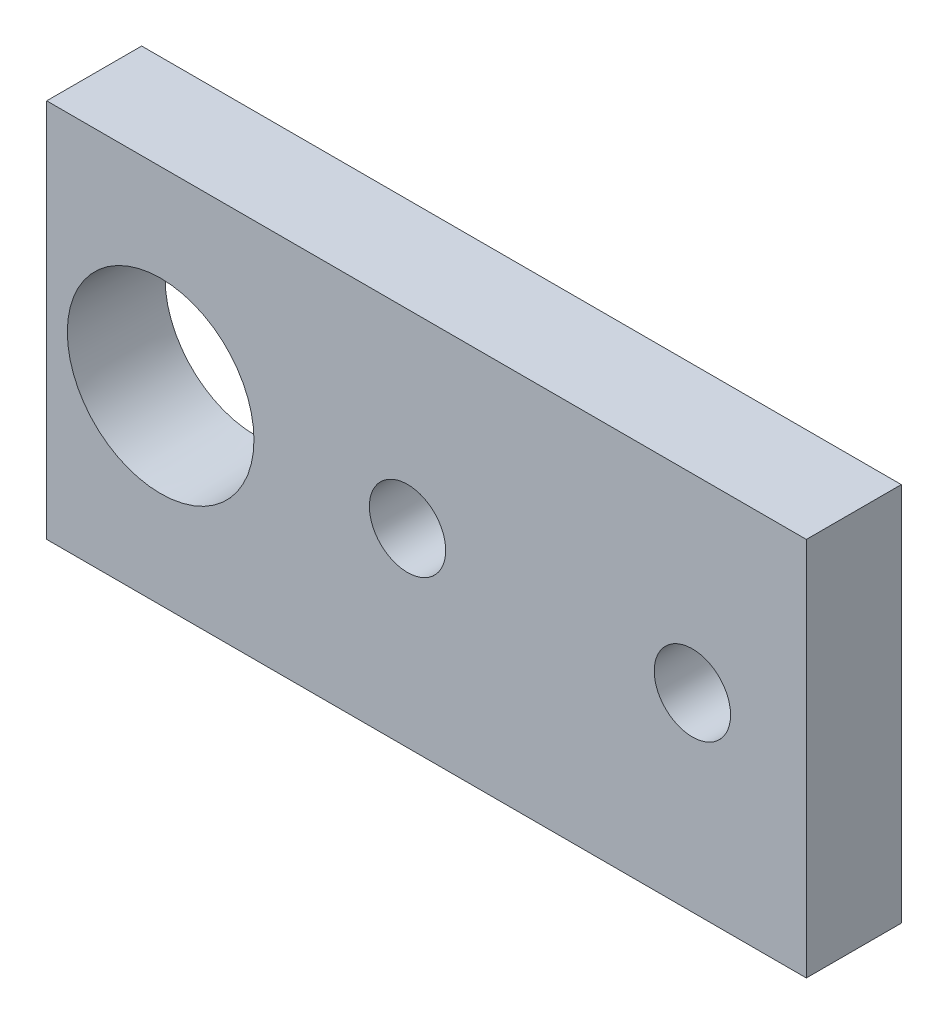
ISO-10303-21;
HEADER;
FILE_DESCRIPTION(('STEP AP214'),'2;1');
FILE_NAME('part.step','',(''),(''),'','','');
FILE_SCHEMA(('AUTOMOTIVE_DESIGN { 1 0 10303 214 1 1 1 1 }'));
ENDSEC;
DATA;
#1=APPLICATION_CONTEXT('core data for automotive mechanical design processes');
#2=APPLICATION_PROTOCOL_DEFINITION('international standard','automotive_design',2000,#1);
#3=PRODUCT_CONTEXT('',#1,'mechanical');
#4=PRODUCT('Part','Part','',(#3));
#5=PRODUCT_RELATED_PRODUCT_CATEGORY('part','',(#4));
#6=PRODUCT_DEFINITION_FORMATION('','',#4);
#7=PRODUCT_DEFINITION_CONTEXT('part definition',#1,'design');
#8=PRODUCT_DEFINITION('design','',#6,#7);
#9=PRODUCT_DEFINITION_SHAPE('','',#8);
#10=(LENGTH_UNIT() NAMED_UNIT(*) SI_UNIT(.MILLI.,.METRE.));
#11=(NAMED_UNIT(*) PLANE_ANGLE_UNIT() SI_UNIT($,.RADIAN.));
#12=(NAMED_UNIT(*) SI_UNIT($,.STERADIAN.) SOLID_ANGLE_UNIT());
#13=UNCERTAINTY_MEASURE_WITH_UNIT(LENGTH_MEASURE(1.E-05),#10,'distance_accuracy_value','');
#14=(GEOMETRIC_REPRESENTATION_CONTEXT(3) GLOBAL_UNCERTAINTY_ASSIGNED_CONTEXT((#13)) GLOBAL_UNIT_ASSIGNED_CONTEXT((#10,
#11,#12)) REPRESENTATION_CONTEXT('',''));
#15=CARTESIAN_POINT('',(0.,0.,0.));
#16=DIRECTION('',(0.,0.,1.));
#17=DIRECTION('',(1.,0.,0.));
#18=AXIS2_PLACEMENT_3D('',#15,#16,#17);
#19=CARTESIAN_POINT('',(0.,25.4,0.));
#20=DIRECTION('',(0.,0.,-1.));
#21=DIRECTION('',(-1.,0.,0.));
#22=AXIS2_PLACEMENT_3D('',#19,#20,#21);
#23=PLANE('',#22);
#24=CARTESIAN_POINT('',(7.62,12.7,0.));
#25=DIRECTION('',(0.,0.,-1.));
#26=DIRECTION('',(-1.,0.,0.));
#27=AXIS2_PLACEMENT_3D('',#24,#25,#26);
#28=CIRCLE('',#27,6.05015719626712);
#29=CARTESIAN_POINT('',(1.56984280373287,12.7,0.));
#30=VERTEX_POINT('',#29);
#31=EDGE_CURVE('E40',#30,#30,#28,.T.);
#32=ORIENTED_EDGE('',*,*,#31,.F.);
#33=EDGE_LOOP('',(#32));
#34=FACE_BOUND('',#33,.T.);
#35=DIRECTION('',(0.,-1.,0.));
#36=VECTOR('',#35,1.);
#37=CARTESIAN_POINT('',(0.,0.,0.));
#38=LINE('',#37,#36);
#39=CARTESIAN_POINT('',(0.,25.4,0.));
#40=VERTEX_POINT('',#39);
#41=CARTESIAN_POINT('',(0.,0.,0.));
#42=VERTEX_POINT('',#41);
#43=EDGE_CURVE('E82',#40,#42,#38,.T.);
#44=ORIENTED_EDGE('',*,*,#43,.F.);
#45=DIRECTION('',(-1.,0.,0.));
#46=VECTOR('',#45,1.);
#47=CARTESIAN_POINT('',(0.,25.4,0.));
#48=LINE('',#47,#46);
#49=CARTESIAN_POINT('',(50.8,25.4,0.));
#50=VERTEX_POINT('',#49);
#51=EDGE_CURVE('E103',#50,#40,#48,.T.);
#52=ORIENTED_EDGE('',*,*,#51,.F.);
#53=DIRECTION('',(0.,1.,0.));
#54=VECTOR('',#53,1.);
#55=CARTESIAN_POINT('',(50.8,0.,0.));
#56=LINE('',#55,#54);
#57=CARTESIAN_POINT('',(50.8,0.,0.));
#58=VERTEX_POINT('',#57);
#59=EDGE_CURVE('E83',#58,#50,#56,.T.);
#60=ORIENTED_EDGE('',*,*,#59,.F.);
#61=DIRECTION('',(1.,0.,0.));
#62=VECTOR('',#61,1.);
#63=CARTESIAN_POINT('',(0.,0.,0.));
#64=LINE('',#63,#62);
#65=EDGE_CURVE('E78',#42,#58,#64,.T.);
#66=ORIENTED_EDGE('',*,*,#65,.F.);
#67=EDGE_LOOP('',(#44,#52,#60,#66));
#68=FACE_BOUND('',#67,.T.);
#69=CARTESIAN_POINT('',(24.13,12.7,0.));
#70=DIRECTION('',(0.,0.,1.));
#71=DIRECTION('',(1.,0.,0.));
#72=AXIS2_PLACEMENT_3D('',#69,#70,#71);
#73=CIRCLE('',#72,2.5527);
#74=CARTESIAN_POINT('',(26.6827,12.7,0.));
#75=VERTEX_POINT('',#74);
#76=EDGE_CURVE('E95',#75,#75,#73,.T.);
#77=ORIENTED_EDGE('',*,*,#76,.T.);
#78=EDGE_LOOP('',(#77));
#79=FACE_BOUND('',#78,.T.);
#80=CARTESIAN_POINT('',(43.18,12.7,0.));
#81=DIRECTION('',(0.,0.,1.));
#82=DIRECTION('',(1.,0.,0.));
#83=AXIS2_PLACEMENT_3D('',#80,#81,#82);
#84=CIRCLE('',#83,2.5527);
#85=CARTESIAN_POINT('',(45.7327,12.7,0.));
#86=VERTEX_POINT('',#85);
#87=EDGE_CURVE('E158',#86,#86,#84,.T.);
#88=ORIENTED_EDGE('',*,*,#87,.T.);
#89=EDGE_LOOP('',(#88));
#90=FACE_BOUND('',#89,.T.);
#91=ADVANCED_FACE('F36',(#34,#68,#79,#90),#23,.T.);
#92=CARTESIAN_POINT('',(0.,0.,6.35));
#93=DIRECTION('',(1.,0.,0.));
#94=DIRECTION('',(0.,0.,-1.));
#95=AXIS2_PLACEMENT_3D('',#92,#93,#94);
#96=PLANE('',#95);
#97=ORIENTED_EDGE('',*,*,#43,.T.);
#98=DIRECTION('',(0.,0.,-1.));
#99=VECTOR('',#98,1.);
#100=CARTESIAN_POINT('',(0.,0.,6.35));
#101=LINE('',#100,#99);
#102=CARTESIAN_POINT('',(0.,0.,6.35));
#103=VERTEX_POINT('',#102);
#104=EDGE_CURVE('E11',#103,#42,#101,.T.);
#105=ORIENTED_EDGE('',*,*,#104,.F.);
#106=DIRECTION('',(0.,-1.,0.));
#107=VECTOR('',#106,1.);
#108=CARTESIAN_POINT('',(0.,0.,6.35));
#109=LINE('',#108,#107);
#110=CARTESIAN_POINT('',(0.,25.4,6.35));
#111=VERTEX_POINT('',#110);
#112=EDGE_CURVE('E105',#111,#103,#109,.T.);
#113=ORIENTED_EDGE('',*,*,#112,.F.);
#114=DIRECTION('',(0.,0.,-1.));
#115=VECTOR('',#114,1.);
#116=CARTESIAN_POINT('',(0.,25.4,6.35));
#117=LINE('',#116,#115);
#118=EDGE_CURVE('E94',#111,#40,#117,.T.);
#119=ORIENTED_EDGE('',*,*,#118,.T.);
#120=EDGE_LOOP('',(#97,#105,#113,#119));
#121=FACE_BOUND('',#120,.T.);
#122=ADVANCED_FACE('F38',(#121),#96,.F.);
#123=CARTESIAN_POINT('',(0.,0.,6.35));
#124=DIRECTION('',(0.,1.,0.));
#125=DIRECTION('',(0.,0.,1.));
#126=AXIS2_PLACEMENT_3D('',#123,#124,#125);
#127=PLANE('',#126);
#128=ORIENTED_EDGE('',*,*,#65,.T.);
#129=DIRECTION('',(0.,0.,-1.));
#130=VECTOR('',#129,1.);
#131=CARTESIAN_POINT('',(50.8,0.,6.35));
#132=LINE('',#131,#130);
#133=CARTESIAN_POINT('',(50.8,0.,6.35));
#134=VERTEX_POINT('',#133);
#135=EDGE_CURVE('E45',#134,#58,#132,.T.);
#136=ORIENTED_EDGE('',*,*,#135,.F.);
#137=DIRECTION('',(1.,0.,0.));
#138=VECTOR('',#137,1.);
#139=CARTESIAN_POINT('',(0.,0.,6.35));
#140=LINE('',#139,#138);
#141=EDGE_CURVE('E90',#103,#134,#140,.T.);
#142=ORIENTED_EDGE('',*,*,#141,.F.);
#143=ORIENTED_EDGE('',*,*,#104,.T.);
#144=EDGE_LOOP('',(#128,#136,#142,#143));
#145=FACE_BOUND('',#144,.T.);
#146=ADVANCED_FACE('F89',(#145),#127,.F.);
#147=CARTESIAN_POINT('',(50.8,0.,6.35));
#148=DIRECTION('',(-1.,0.,0.));
#149=DIRECTION('',(0.,0.,1.));
#150=AXIS2_PLACEMENT_3D('',#147,#148,#149);
#151=PLANE('',#150);
#152=ORIENTED_EDGE('',*,*,#59,.T.);
#153=DIRECTION('',(0.,0.,-1.));
#154=VECTOR('',#153,1.);
#155=CARTESIAN_POINT('',(50.8,25.4,6.35));
#156=LINE('',#155,#154);
#157=CARTESIAN_POINT('',(50.8,25.4,6.35));
#158=VERTEX_POINT('',#157);
#159=EDGE_CURVE('E111',#158,#50,#156,.T.);
#160=ORIENTED_EDGE('',*,*,#159,.F.);
#161=DIRECTION('',(0.,1.,0.));
#162=VECTOR('',#161,1.);
#163=CARTESIAN_POINT('',(50.8,0.,6.35));
#164=LINE('',#163,#162);
#165=EDGE_CURVE('E57',#134,#158,#164,.T.);
#166=ORIENTED_EDGE('',*,*,#165,.F.);
#167=ORIENTED_EDGE('',*,*,#135,.T.);
#168=EDGE_LOOP('',(#152,#160,#166,#167));
#169=FACE_BOUND('',#168,.T.);
#170=ADVANCED_FACE('F115',(#169),#151,.F.);
#171=CARTESIAN_POINT('',(0.,25.4,6.35));
#172=DIRECTION('',(0.,-1.,0.));
#173=DIRECTION('',(0.,0.,-1.));
#174=AXIS2_PLACEMENT_3D('',#171,#172,#173);
#175=PLANE('',#174);
#176=ORIENTED_EDGE('',*,*,#51,.T.);
#177=ORIENTED_EDGE('',*,*,#118,.F.);
#178=DIRECTION('',(-1.,0.,0.));
#179=VECTOR('',#178,1.);
#180=CARTESIAN_POINT('',(0.,25.4,6.35));
#181=LINE('',#180,#179);
#182=EDGE_CURVE('E52',#158,#111,#181,.T.);
#183=ORIENTED_EDGE('',*,*,#182,.F.);
#184=ORIENTED_EDGE('',*,*,#159,.T.);
#185=EDGE_LOOP('',(#176,#177,#183,#184));
#186=FACE_BOUND('',#185,.T.);
#187=ADVANCED_FACE('F117',(#186),#175,.F.);
#188=CARTESIAN_POINT('',(0.,25.4,6.35));
#189=DIRECTION('',(0.,0.,-1.));
#190=DIRECTION('',(-1.,0.,0.));
#191=AXIS2_PLACEMENT_3D('',#188,#189,#190);
#192=PLANE('',#191);
#193=CARTESIAN_POINT('',(7.62,12.7,6.35));
#194=DIRECTION('',(0.,0.,1.));
#195=DIRECTION('',(1.,0.,0.));
#196=AXIS2_PLACEMENT_3D('',#193,#194,#195);
#197=CIRCLE('',#196,6.2402847);
#198=CARTESIAN_POINT('',(13.8602847,12.7,6.35));
#199=VERTEX_POINT('',#198);
#200=EDGE_CURVE('E152',#199,#199,#197,.T.);
#201=ORIENTED_EDGE('',*,*,#200,.F.);
#202=EDGE_LOOP('',(#201));
#203=FACE_BOUND('',#202,.T.);
#204=CARTESIAN_POINT('',(43.18,12.7,6.35));
#205=DIRECTION('',(0.,0.,1.));
#206=DIRECTION('',(1.,0.,0.));
#207=AXIS2_PLACEMENT_3D('',#204,#205,#206);
#208=CIRCLE('',#207,2.5527);
#209=CARTESIAN_POINT('',(45.7327,12.7,6.35));
#210=VERTEX_POINT('',#209);
#211=EDGE_CURVE('E154',#210,#210,#208,.T.);
#212=ORIENTED_EDGE('',*,*,#211,.F.);
#213=EDGE_LOOP('',(#212));
#214=FACE_BOUND('',#213,.T.);
#215=CARTESIAN_POINT('',(24.13,12.7,6.35));
#216=DIRECTION('',(0.,0.,1.));
#217=DIRECTION('',(1.,0.,0.));
#218=AXIS2_PLACEMENT_3D('',#215,#216,#217);
#219=CIRCLE('',#218,2.5527);
#220=CARTESIAN_POINT('',(26.6827,12.7,6.35));
#221=VERTEX_POINT('',#220);
#222=EDGE_CURVE('E98',#221,#221,#219,.T.);
#223=ORIENTED_EDGE('',*,*,#222,.F.);
#224=EDGE_LOOP('',(#223));
#225=FACE_BOUND('',#224,.T.);
#226=ORIENTED_EDGE('',*,*,#112,.T.);
#227=ORIENTED_EDGE('',*,*,#141,.T.);
#228=ORIENTED_EDGE('',*,*,#165,.T.);
#229=ORIENTED_EDGE('',*,*,#182,.T.);
#230=EDGE_LOOP('',(#226,#227,#228,#229));
#231=FACE_BOUND('',#230,.T.);
#232=ADVANCED_FACE('F118',(#203,#214,#225,#231),#192,.F.);
#233=CARTESIAN_POINT('',(24.13,12.7,0.));
#234=DIRECTION('',(0.,0.,1.));
#235=DIRECTION('',(1.,0.,0.));
#236=AXIS2_PLACEMENT_3D('',#233,#234,#235);
#237=CYLINDRICAL_SURFACE('',#236,2.5527);
#238=ORIENTED_EDGE('',*,*,#76,.F.);
#239=EDGE_LOOP('',(#238));
#240=FACE_BOUND('',#239,.T.);
#241=ORIENTED_EDGE('',*,*,#222,.T.);
#242=EDGE_LOOP('',(#241));
#243=FACE_BOUND('',#242,.T.);
#244=ADVANCED_FACE('F120',(#240,#243),#237,.F.);
#245=CARTESIAN_POINT('',(43.18,12.7,0.));
#246=DIRECTION('',(0.,0.,1.));
#247=DIRECTION('',(1.,0.,0.));
#248=AXIS2_PLACEMENT_3D('',#245,#246,#247);
#249=CYLINDRICAL_SURFACE('',#248,2.5527);
#250=ORIENTED_EDGE('',*,*,#87,.F.);
#251=EDGE_LOOP('',(#250));
#252=FACE_BOUND('',#251,.T.);
#253=ORIENTED_EDGE('',*,*,#211,.T.);
#254=EDGE_LOOP('',(#253));
#255=FACE_BOUND('',#254,.T.);
#256=ADVANCED_FACE('F127',(#252,#255),#249,.F.);
#257=CARTESIAN_POINT('',(7.62,12.7,6.35));
#258=DIRECTION('',(0.,0.,1.));
#259=DIRECTION('',(1.,0.,0.));
#260=AXIS2_PLACEMENT_3D('',#257,#258,#259);
#261=CONICAL_SURFACE('',#260,6.2402847,0.0299323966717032);
#262=ORIENTED_EDGE('',*,*,#31,.T.);
#263=EDGE_LOOP('',(#262));
#264=FACE_BOUND('',#263,.T.);
#265=ORIENTED_EDGE('',*,*,#200,.T.);
#266=EDGE_LOOP('',(#265));
#267=FACE_BOUND('',#266,.T.);
#268=ADVANCED_FACE('F143',(#264,#267),#261,.F.);
#269=CLOSED_SHELL('',(#91,#122,#146,#170,#187,#232,#244,#256,#268));
#270=MANIFOLD_SOLID_BREP('B2',#269);
#271=ADVANCED_BREP_SHAPE_REPRESENTATION('',(#18,#270),#14);
#272=SHAPE_DEFINITION_REPRESENTATION(#9,#271);
ENDSEC;
END-ISO-10303-21;
